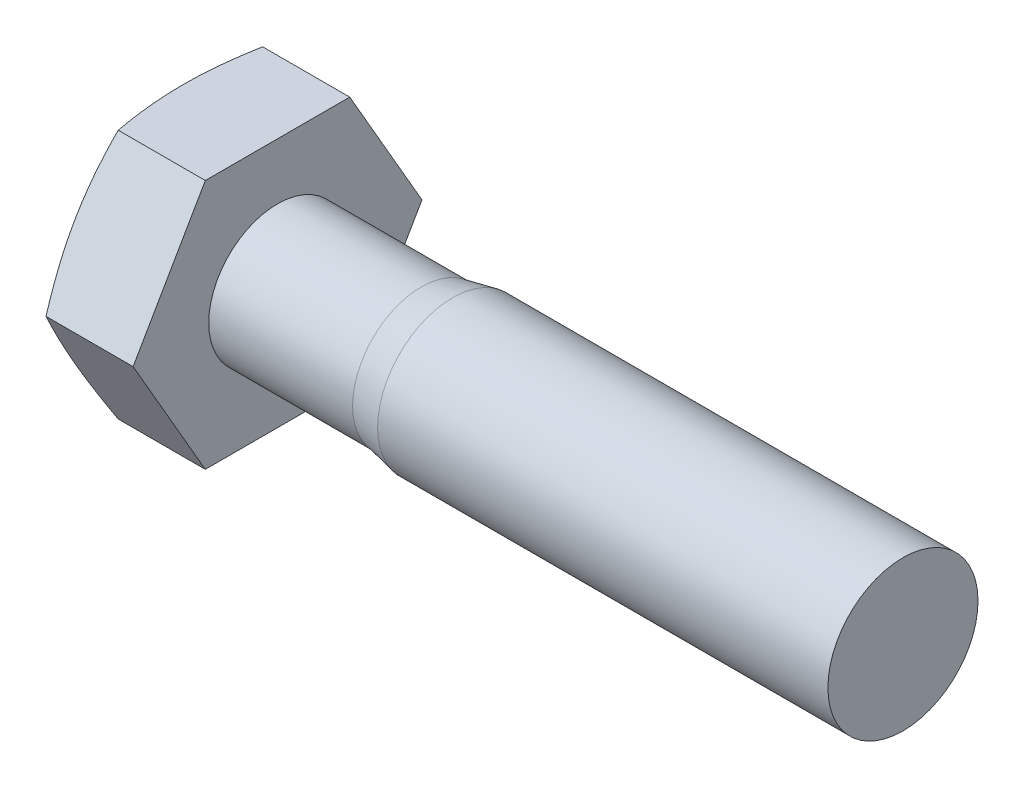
from build123d import *

# Parameters (mm, degrees)
BASEHEAD_DEPTH     = 4
SKETCH2_R          = 3
BASEBODY_DEPTH     = 25
SKETCH4_R          = 3.4
CUT_EXTRUDE1_DEPTH = 0.8


with BuildPart() as part:
    # Sketch1 → BaseHead (new body)
    with BuildSketch(Plane(origin=(0, 0, 0), x_dir=(0, 0, -1), z_dir=(1, 0, 0))):
        Polygon((5.773502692, 0), (2.886751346, 5), (-2.886751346, 5), (-5.773502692, 0), (-2.886751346, -5), (2.886751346, -5), align=None)
    extrude(amount=BASEHEAD_DEPTH)

    # Sketch2 → BaseBody (add)
    with BuildSketch(Plane(origin=(4, 0, 0), x_dir=(0, 0, -1), z_dir=(1, 0, 0))):
        Circle(SKETCH2_R)
    extrude(amount=BASEBODY_DEPTH)

    # Sketch3 → HeadChamfer (revolve, cut)
    with BuildSketch(Plane(origin=(3.161211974, 0, 2.612290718), x_dir=(0, 0, -1), z_dir=(0, 1, 0)), mode=Mode.PRIVATE) as headchamfer_sk:
        Polygon((8.38579341, 3.161211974), (8.38579341, 2.643099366), (6.962290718, 3.161211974), align=None)
    revolve(headchamfer_sk.sketch.rotate(Axis((-2.071354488, 0, 0), (1, 0, 0)), 180), axis=Axis((-2.071354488, 0, 0), (1, 0, 0)), mode=Mode.SUBTRACT)

    # Sketch4 → Cut-Extrude1 (cut)
    with BuildSketch(Plane.ZY):
        Circle(SKETCH4_R)
    extrude(amount=-CUT_EXTRUDE1_DEPTH, mode=Mode.SUBTRACT)

    # Sketch5 → Cut-Revolve1 (revolve, cut)
    with BuildSketch(Plane(origin=(-2.67963122, 0, 8.17963122), x_dir=(0, 0, -1), z_dir=(0, 1, 0)), mode=Mode.PRIVATE) as cut_revolve1_sk:
        Polygon((11.17963122, -13.67963122), (10.92963122, -12.42963122), (10.92963122, -6.67963122), (13.67963122, -6.67963122), (13.67963122, -13.67963122), align=None)
    revolve(cut_revolve1_sk.sketch.rotate(Axis((-2.697175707, 0, 0), (1, 0, 0)), 180), axis=Axis((-2.697175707, 0, 0), (1, 0, 0)), mode=Mode.SUBTRACT)


solid = part.part
